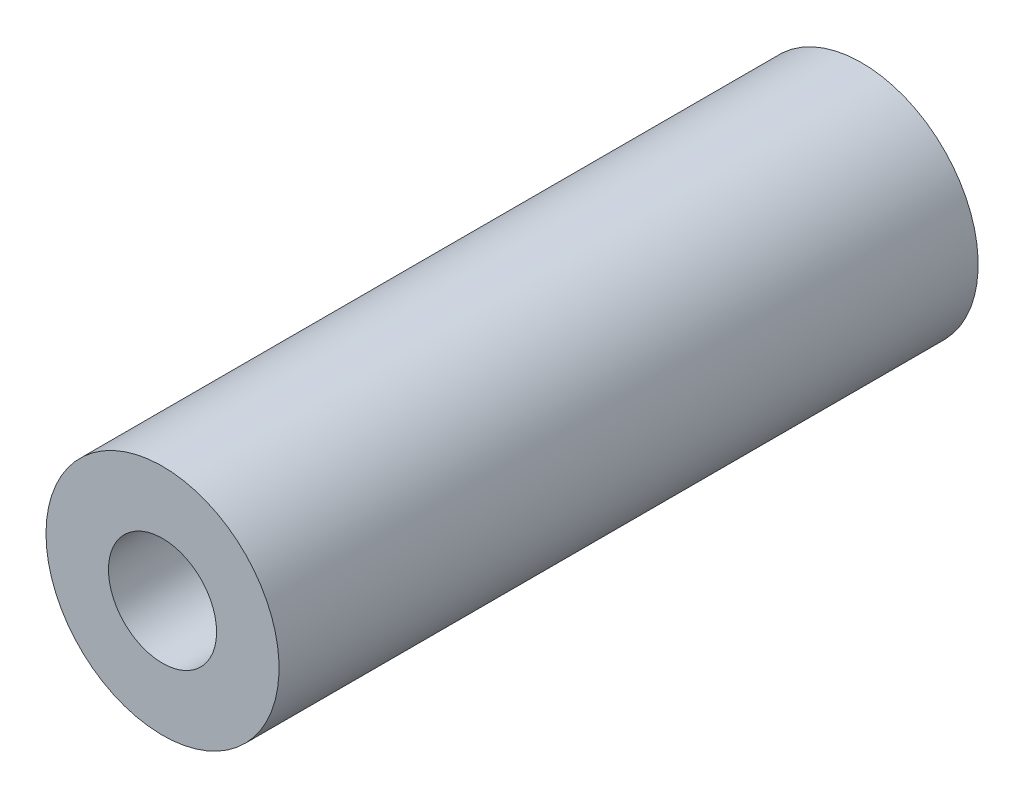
from build123d import *

# Parameters (mm, degrees)
SKETCH1_R             = 3.175
BOSS_EXTRUDE1_DEPTH   = 19.05
F_4_CLEARANCE_HOLE1_D = 2.9464


with BuildPart() as part:
    # Sketch1 → Boss-Extrude1 (new body)
    with BuildSketch(Plane.XY):
        with Locations(Location((0, 0, 0), (0, 0, 180))):
            Circle(SKETCH1_R)
    extrude(amount=BOSS_EXTRUDE1_DEPTH)

    # 4 Clearance Hole1 (through all)
    with Locations(Plane.XY.offset(19.05)):
        with Locations((0, 0)):
            Hole(F_4_CLEARANCE_HOLE1_D / 2)


solid = part.part
